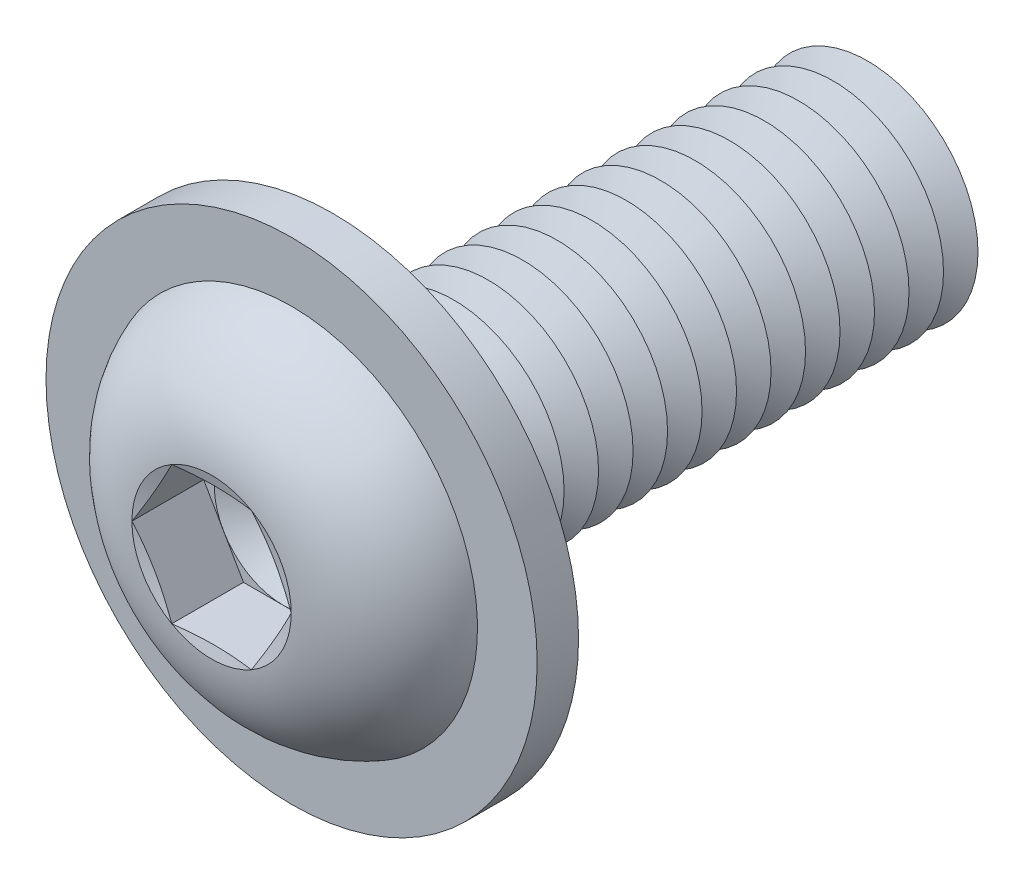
ISO-10303-21;
HEADER;
FILE_DESCRIPTION(('STEP AP214'),'2;1');
FILE_NAME('part.step','',(''),(''),'','','');
FILE_SCHEMA(('AUTOMOTIVE_DESIGN { 1 0 10303 214 1 1 1 1 }'));
ENDSEC;
DATA;
#1=APPLICATION_CONTEXT('core data for automotive mechanical design processes');
#2=APPLICATION_PROTOCOL_DEFINITION('international standard','automotive_design',2000,#1);
#3=PRODUCT_CONTEXT('',#1,'mechanical');
#4=PRODUCT('Part','Part','',(#3));
#5=PRODUCT_RELATED_PRODUCT_CATEGORY('part','',(#4));
#6=PRODUCT_DEFINITION_FORMATION('','',#4);
#7=PRODUCT_DEFINITION_CONTEXT('part definition',#1,'design');
#8=PRODUCT_DEFINITION('design','',#6,#7);
#9=PRODUCT_DEFINITION_SHAPE('','',#8);
#10=(LENGTH_UNIT() NAMED_UNIT(*) SI_UNIT(.MILLI.,.METRE.));
#11=(NAMED_UNIT(*) PLANE_ANGLE_UNIT() SI_UNIT($,.RADIAN.));
#12=(NAMED_UNIT(*) SI_UNIT($,.STERADIAN.) SOLID_ANGLE_UNIT());
#13=UNCERTAINTY_MEASURE_WITH_UNIT(LENGTH_MEASURE(1.E-05),#10,'distance_accuracy_value','');
#14=(GEOMETRIC_REPRESENTATION_CONTEXT(3) GLOBAL_UNCERTAINTY_ASSIGNED_CONTEXT((#13)) GLOBAL_UNIT_ASSIGNED_CONTEXT((#10,
#11,#12)) REPRESENTATION_CONTEXT('',''));
#15=CARTESIAN_POINT('',(0.,0.,0.));
#16=DIRECTION('',(0.,0.,1.));
#17=DIRECTION('',(1.,0.,0.));
#18=AXIS2_PLACEMENT_3D('',#15,#16,#17);
#19=CARTESIAN_POINT('',(0.,0.,-15.625));
#20=DIRECTION('',(0.,0.,1.));
#21=DIRECTION('',(1.,0.,0.));
#22=AXIS2_PLACEMENT_3D('',#19,#20,#21);
#23=CONICAL_SURFACE('',#22,4.00000000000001,1.0471975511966);
#24=CARTESIAN_POINT('',(0.,0.,-16.25));
#25=DIRECTION('',(0.,0.,1.));
#26=DIRECTION('',(1.,0.,0.));
#27=AXIS2_PLACEMENT_3D('',#24,#25,#26);
#28=CIRCLE('',#27,2.91746824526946);
#29=CARTESIAN_POINT('',(2.91746824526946,0.,-16.25));
#30=VERTEX_POINT('',#29);
#31=EDGE_CURVE('E338',#30,#30,#28,.T.);
#32=ORIENTED_EDGE('',*,*,#31,.T.);
#33=EDGE_LOOP('',(#32));
#34=FACE_BOUND('',#33,.T.);
#35=CARTESIAN_POINT('',(0.,0.,-15.625));
#36=DIRECTION('',(0.,0.,1.));
#37=DIRECTION('',(1.,0.,0.));
#38=AXIS2_PLACEMENT_3D('',#35,#36,#37);
#39=CIRCLE('',#38,4.00000000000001);
#40=CARTESIAN_POINT('',(4.00000000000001,0.,-15.625));
#41=VERTEX_POINT('',#40);
#42=EDGE_CURVE('E334',#41,#41,#39,.T.);
#43=ORIENTED_EDGE('',*,*,#42,.F.);
#44=EDGE_LOOP('',(#43));
#45=FACE_BOUND('',#44,.T.);
#46=ADVANCED_FACE('F39',(#34,#45),#23,.T.);
#47=CARTESIAN_POINT('',(0.,0.,-16.25));
#48=DIRECTION('',(0.,0.,-1.));
#49=DIRECTION('',(-1.,0.,0.));
#50=AXIS2_PLACEMENT_3D('',#47,#48,#49);
#51=CONICAL_SURFACE('',#50,2.91746824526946,1.0471975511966);
#52=CARTESIAN_POINT('',(0.,0.,-16.875));
#53=DIRECTION('',(0.,0.,1.));
#54=DIRECTION('',(1.,0.,0.));
#55=AXIS2_PLACEMENT_3D('',#52,#53,#54);
#56=CIRCLE('',#55,4.00000000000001);
#57=CARTESIAN_POINT('',(4.00000000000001,0.,-16.875));
#58=VERTEX_POINT('',#57);
#59=EDGE_CURVE('E342',#58,#58,#56,.T.);
#60=ORIENTED_EDGE('',*,*,#59,.T.);
#61=EDGE_LOOP('',(#60));
#62=FACE_BOUND('',#61,.T.);
#63=ORIENTED_EDGE('',*,*,#31,.F.);
#64=EDGE_LOOP('',(#63));
#65=FACE_BOUND('',#64,.T.);
#66=ADVANCED_FACE('F469',(#62,#65),#51,.T.);
#67=CARTESIAN_POINT('',(0.,4.00000000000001,-20.));
#68=DIRECTION('',(0.,0.,-1.));
#69=DIRECTION('',(-1.,0.,0.));
#70=AXIS2_PLACEMENT_3D('',#67,#68,#69);
#71=PLANE('',#70);
#72=CARTESIAN_POINT('',(0.,0.,-20.));
#73=DIRECTION('',(0.,0.,1.));
#74=DIRECTION('',(1.,0.,0.));
#75=AXIS2_PLACEMENT_3D('',#72,#73,#74);
#76=CIRCLE('',#75,2.91746824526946);
#77=CARTESIAN_POINT('',(2.91746824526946,0.,-20.));
#78=VERTEX_POINT('',#77);
#79=EDGE_CURVE('E361',#78,#78,#76,.T.);
#80=ORIENTED_EDGE('',*,*,#79,.F.);
#81=EDGE_LOOP('',(#80));
#82=FACE_BOUND('',#81,.T.);
#83=ADVANCED_FACE('F475',(#82),#71,.T.);
#84=CARTESIAN_POINT('',(0.,0.,-19.375));
#85=DIRECTION('',(0.,0.,1.));
#86=DIRECTION('',(1.,0.,0.));
#87=AXIS2_PLACEMENT_3D('',#84,#85,#86);
#88=CONICAL_SURFACE('',#87,4.00000000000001,1.0471975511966);
#89=ORIENTED_EDGE('',*,*,#79,.T.);
#90=EDGE_LOOP('',(#89));
#91=FACE_BOUND('',#90,.T.);
#92=CARTESIAN_POINT('',(0.,0.,-19.375));
#93=DIRECTION('',(0.,0.,1.));
#94=DIRECTION('',(1.,0.,0.));
#95=AXIS2_PLACEMENT_3D('',#92,#93,#94);
#96=CIRCLE('',#95,4.00000000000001);
#97=CARTESIAN_POINT('',(4.00000000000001,0.,-19.375));
#98=VERTEX_POINT('',#97);
#99=EDGE_CURVE('E357',#98,#98,#96,.T.);
#100=ORIENTED_EDGE('',*,*,#99,.F.);
#101=EDGE_LOOP('',(#100));
#102=FACE_BOUND('',#101,.T.);
#103=ADVANCED_FACE('F494',(#91,#102),#88,.T.);
#104=CARTESIAN_POINT('',(0.,0.,-18.75));
#105=DIRECTION('',(0.,0.,-1.));
#106=DIRECTION('',(-1.,0.,0.));
#107=AXIS2_PLACEMENT_3D('',#104,#105,#106);
#108=CONICAL_SURFACE('',#107,2.91746824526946,1.0471975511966);
#109=ORIENTED_EDGE('',*,*,#99,.T.);
#110=EDGE_LOOP('',(#109));
#111=FACE_BOUND('',#110,.T.);
#112=CARTESIAN_POINT('',(0.,0.,-18.75));
#113=DIRECTION('',(0.,0.,1.));
#114=DIRECTION('',(1.,0.,0.));
#115=AXIS2_PLACEMENT_3D('',#112,#113,#114);
#116=CIRCLE('',#115,2.91746824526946);
#117=CARTESIAN_POINT('',(2.91746824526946,0.,-18.75));
#118=VERTEX_POINT('',#117);
#119=EDGE_CURVE('E353',#118,#118,#116,.T.);
#120=ORIENTED_EDGE('',*,*,#119,.F.);
#121=EDGE_LOOP('',(#120));
#122=FACE_BOUND('',#121,.T.);
#123=ADVANCED_FACE('F491',(#111,#122),#108,.T.);
#124=CARTESIAN_POINT('',(0.,0.,-18.125));
#125=DIRECTION('',(0.,0.,1.));
#126=DIRECTION('',(1.,0.,0.));
#127=AXIS2_PLACEMENT_3D('',#124,#125,#126);
#128=CONICAL_SURFACE('',#127,4.00000000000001,1.0471975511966);
#129=ORIENTED_EDGE('',*,*,#119,.T.);
#130=EDGE_LOOP('',(#129));
#131=FACE_BOUND('',#130,.T.);
#132=CARTESIAN_POINT('',(0.,0.,-18.125));
#133=DIRECTION('',(0.,0.,1.));
#134=DIRECTION('',(1.,0.,0.));
#135=AXIS2_PLACEMENT_3D('',#132,#133,#134);
#136=CIRCLE('',#135,4.00000000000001);
#137=CARTESIAN_POINT('',(4.00000000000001,0.,-18.125));
#138=VERTEX_POINT('',#137);
#139=EDGE_CURVE('E349',#138,#138,#136,.T.);
#140=ORIENTED_EDGE('',*,*,#139,.F.);
#141=EDGE_LOOP('',(#140));
#142=FACE_BOUND('',#141,.T.);
#143=ADVANCED_FACE('F485',(#131,#142),#128,.T.);
#144=CARTESIAN_POINT('',(0.,0.,-17.5));
#145=DIRECTION('',(0.,0.,-1.));
#146=DIRECTION('',(-1.,0.,0.));
#147=AXIS2_PLACEMENT_3D('',#144,#145,#146);
#148=CONICAL_SURFACE('',#147,2.91746824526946,1.0471975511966);
#149=ORIENTED_EDGE('',*,*,#139,.T.);
#150=EDGE_LOOP('',(#149));
#151=FACE_BOUND('',#150,.T.);
#152=CARTESIAN_POINT('',(0.,0.,-17.5));
#153=DIRECTION('',(0.,0.,1.));
#154=DIRECTION('',(1.,0.,0.));
#155=AXIS2_PLACEMENT_3D('',#152,#153,#154);
#156=CIRCLE('',#155,2.91746824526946);
#157=CARTESIAN_POINT('',(2.91746824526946,0.,-17.5));
#158=VERTEX_POINT('',#157);
#159=EDGE_CURVE('E345',#158,#158,#156,.T.);
#160=ORIENTED_EDGE('',*,*,#159,.F.);
#161=EDGE_LOOP('',(#160));
#162=FACE_BOUND('',#161,.T.);
#163=ADVANCED_FACE('F481',(#151,#162),#148,.T.);
#164=CARTESIAN_POINT('',(0.,0.,-16.875));
#165=DIRECTION('',(0.,0.,1.));
#166=DIRECTION('',(1.,0.,0.));
#167=AXIS2_PLACEMENT_3D('',#164,#165,#166);
#168=CONICAL_SURFACE('',#167,4.00000000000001,1.0471975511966);
#169=ORIENTED_EDGE('',*,*,#159,.T.);
#170=EDGE_LOOP('',(#169));
#171=FACE_BOUND('',#170,.T.);
#172=ORIENTED_EDGE('',*,*,#59,.F.);
#173=EDGE_LOOP('',(#172));
#174=FACE_BOUND('',#173,.T.);
#175=ADVANCED_FACE('F484',(#171,#174),#168,.T.);
#176=CARTESIAN_POINT('',(0.,0.,-14.375));
#177=DIRECTION('',(0.,0.,1.));
#178=DIRECTION('',(1.,0.,0.));
#179=AXIS2_PLACEMENT_3D('',#176,#177,#178);
#180=CONICAL_SURFACE('',#179,4.00000000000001,1.0471975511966);
#181=CARTESIAN_POINT('',(0.,0.,-15.));
#182=DIRECTION('',(0.,0.,1.));
#183=DIRECTION('',(1.,0.,0.));
#184=AXIS2_PLACEMENT_3D('',#181,#182,#183);
#185=CIRCLE('',#184,2.91746824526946);
#186=CARTESIAN_POINT('',(2.91746824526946,0.,-15.));
#187=VERTEX_POINT('',#186);
#188=EDGE_CURVE('E330',#187,#187,#185,.T.);
#189=ORIENTED_EDGE('',*,*,#188,.T.);
#190=EDGE_LOOP('',(#189));
#191=FACE_BOUND('',#190,.T.);
#192=CARTESIAN_POINT('',(0.,0.,-14.375));
#193=DIRECTION('',(0.,0.,1.));
#194=DIRECTION('',(1.,0.,0.));
#195=AXIS2_PLACEMENT_3D('',#192,#193,#194);
#196=CIRCLE('',#195,4.00000000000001);
#197=CARTESIAN_POINT('',(4.00000000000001,0.,-14.375));
#198=VERTEX_POINT('',#197);
#199=EDGE_CURVE('E326',#198,#198,#196,.T.);
#200=ORIENTED_EDGE('',*,*,#199,.F.);
#201=EDGE_LOOP('',(#200));
#202=FACE_BOUND('',#201,.T.);
#203=ADVANCED_FACE('F489',(#191,#202),#180,.T.);
#204=CARTESIAN_POINT('',(0.,0.,-15.));
#205=DIRECTION('',(0.,0.,-1.));
#206=DIRECTION('',(-1.,0.,0.));
#207=AXIS2_PLACEMENT_3D('',#204,#205,#206);
#208=CONICAL_SURFACE('',#207,2.91746824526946,1.0471975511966);
#209=ORIENTED_EDGE('',*,*,#42,.T.);
#210=EDGE_LOOP('',(#209));
#211=FACE_BOUND('',#210,.T.);
#212=ORIENTED_EDGE('',*,*,#188,.F.);
#213=EDGE_LOOP('',(#212));
#214=FACE_BOUND('',#213,.T.);
#215=ADVANCED_FACE('F540',(#211,#214),#208,.T.);
#216=CARTESIAN_POINT('',(0.,0.,-13.125));
#217=DIRECTION('',(0.,0.,1.));
#218=DIRECTION('',(1.,0.,0.));
#219=AXIS2_PLACEMENT_3D('',#216,#217,#218);
#220=CONICAL_SURFACE('',#219,4.00000000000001,1.0471975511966);
#221=CARTESIAN_POINT('',(0.,0.,-13.75));
#222=DIRECTION('',(0.,0.,1.));
#223=DIRECTION('',(1.,0.,0.));
#224=AXIS2_PLACEMENT_3D('',#221,#222,#223);
#225=CIRCLE('',#224,2.91746824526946);
#226=CARTESIAN_POINT('',(2.91746824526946,0.,-13.75));
#227=VERTEX_POINT('',#226);
#228=EDGE_CURVE('E322',#227,#227,#225,.T.);
#229=ORIENTED_EDGE('',*,*,#228,.T.);
#230=EDGE_LOOP('',(#229));
#231=FACE_BOUND('',#230,.T.);
#232=CARTESIAN_POINT('',(0.,0.,-13.125));
#233=DIRECTION('',(0.,0.,1.));
#234=DIRECTION('',(1.,0.,0.));
#235=AXIS2_PLACEMENT_3D('',#232,#233,#234);
#236=CIRCLE('',#235,4.00000000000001);
#237=CARTESIAN_POINT('',(4.00000000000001,0.,-13.125));
#238=VERTEX_POINT('',#237);
#239=EDGE_CURVE('E318',#238,#238,#236,.T.);
#240=ORIENTED_EDGE('',*,*,#239,.F.);
#241=EDGE_LOOP('',(#240));
#242=FACE_BOUND('',#241,.T.);
#243=ADVANCED_FACE('F546',(#231,#242),#220,.T.);
#244=CARTESIAN_POINT('',(0.,0.,-13.75));
#245=DIRECTION('',(0.,0.,-1.));
#246=DIRECTION('',(-1.,0.,0.));
#247=AXIS2_PLACEMENT_3D('',#244,#245,#246);
#248=CONICAL_SURFACE('',#247,2.91746824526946,1.0471975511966);
#249=ORIENTED_EDGE('',*,*,#199,.T.);
#250=EDGE_LOOP('',(#249));
#251=FACE_BOUND('',#250,.T.);
#252=ORIENTED_EDGE('',*,*,#228,.F.);
#253=EDGE_LOOP('',(#252));
#254=FACE_BOUND('',#253,.T.);
#255=ADVANCED_FACE('F553',(#251,#254),#248,.T.);
#256=CARTESIAN_POINT('',(0.,0.,-11.875));
#257=DIRECTION('',(0.,0.,1.));
#258=DIRECTION('',(1.,0.,0.));
#259=AXIS2_PLACEMENT_3D('',#256,#257,#258);
#260=CONICAL_SURFACE('',#259,4.00000000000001,1.0471975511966);
#261=CARTESIAN_POINT('',(0.,0.,-12.5));
#262=DIRECTION('',(0.,0.,1.));
#263=DIRECTION('',(1.,0.,0.));
#264=AXIS2_PLACEMENT_3D('',#261,#262,#263);
#265=CIRCLE('',#264,2.91746824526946);
#266=CARTESIAN_POINT('',(2.91746824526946,0.,-12.5));
#267=VERTEX_POINT('',#266);
#268=EDGE_CURVE('E314',#267,#267,#265,.T.);
#269=ORIENTED_EDGE('',*,*,#268,.T.);
#270=EDGE_LOOP('',(#269));
#271=FACE_BOUND('',#270,.T.);
#272=CARTESIAN_POINT('',(0.,0.,-11.875));
#273=DIRECTION('',(0.,0.,1.));
#274=DIRECTION('',(1.,0.,0.));
#275=AXIS2_PLACEMENT_3D('',#272,#273,#274);
#276=CIRCLE('',#275,4.00000000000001);
#277=CARTESIAN_POINT('',(4.00000000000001,0.,-11.875));
#278=VERTEX_POINT('',#277);
#279=EDGE_CURVE('E310',#278,#278,#276,.T.);
#280=ORIENTED_EDGE('',*,*,#279,.F.);
#281=EDGE_LOOP('',(#280));
#282=FACE_BOUND('',#281,.T.);
#283=ADVANCED_FACE('F560',(#271,#282),#260,.T.);
#284=CARTESIAN_POINT('',(0.,0.,-12.5));
#285=DIRECTION('',(0.,0.,-1.));
#286=DIRECTION('',(-1.,0.,0.));
#287=AXIS2_PLACEMENT_3D('',#284,#285,#286);
#288=CONICAL_SURFACE('',#287,2.91746824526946,1.0471975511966);
#289=ORIENTED_EDGE('',*,*,#239,.T.);
#290=EDGE_LOOP('',(#289));
#291=FACE_BOUND('',#290,.T.);
#292=ORIENTED_EDGE('',*,*,#268,.F.);
#293=EDGE_LOOP('',(#292));
#294=FACE_BOUND('',#293,.T.);
#295=ADVANCED_FACE('F567',(#291,#294),#288,.T.);
#296=CARTESIAN_POINT('',(0.,0.,-10.625));
#297=DIRECTION('',(0.,0.,1.));
#298=DIRECTION('',(1.,0.,0.));
#299=AXIS2_PLACEMENT_3D('',#296,#297,#298);
#300=CONICAL_SURFACE('',#299,4.00000000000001,1.0471975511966);
#301=CARTESIAN_POINT('',(0.,0.,-11.25));
#302=DIRECTION('',(0.,0.,1.));
#303=DIRECTION('',(1.,0.,0.));
#304=AXIS2_PLACEMENT_3D('',#301,#302,#303);
#305=CIRCLE('',#304,2.91746824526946);
#306=CARTESIAN_POINT('',(2.91746824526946,0.,-11.25));
#307=VERTEX_POINT('',#306);
#308=EDGE_CURVE('E306',#307,#307,#305,.T.);
#309=ORIENTED_EDGE('',*,*,#308,.T.);
#310=EDGE_LOOP('',(#309));
#311=FACE_BOUND('',#310,.T.);
#312=CARTESIAN_POINT('',(0.,0.,-10.625));
#313=DIRECTION('',(0.,0.,1.));
#314=DIRECTION('',(1.,0.,0.));
#315=AXIS2_PLACEMENT_3D('',#312,#313,#314);
#316=CIRCLE('',#315,4.00000000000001);
#317=CARTESIAN_POINT('',(4.00000000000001,0.,-10.625));
#318=VERTEX_POINT('',#317);
#319=EDGE_CURVE('E302',#318,#318,#316,.T.);
#320=ORIENTED_EDGE('',*,*,#319,.F.);
#321=EDGE_LOOP('',(#320));
#322=FACE_BOUND('',#321,.T.);
#323=ADVANCED_FACE('F574',(#311,#322),#300,.T.);
#324=CARTESIAN_POINT('',(0.,0.,-11.25));
#325=DIRECTION('',(0.,0.,-1.));
#326=DIRECTION('',(-1.,0.,0.));
#327=AXIS2_PLACEMENT_3D('',#324,#325,#326);
#328=CONICAL_SURFACE('',#327,2.91746824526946,1.0471975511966);
#329=ORIENTED_EDGE('',*,*,#279,.T.);
#330=EDGE_LOOP('',(#329));
#331=FACE_BOUND('',#330,.T.);
#332=ORIENTED_EDGE('',*,*,#308,.F.);
#333=EDGE_LOOP('',(#332));
#334=FACE_BOUND('',#333,.T.);
#335=ADVANCED_FACE('F581',(#331,#334),#328,.T.);
#336=CARTESIAN_POINT('',(0.,0.,-9.375));
#337=DIRECTION('',(0.,0.,1.));
#338=DIRECTION('',(1.,0.,0.));
#339=AXIS2_PLACEMENT_3D('',#336,#337,#338);
#340=CONICAL_SURFACE('',#339,4.00000000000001,1.0471975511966);
#341=CARTESIAN_POINT('',(0.,0.,-10.));
#342=DIRECTION('',(0.,0.,1.));
#343=DIRECTION('',(1.,0.,0.));
#344=AXIS2_PLACEMENT_3D('',#341,#342,#343);
#345=CIRCLE('',#344,2.91746824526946);
#346=CARTESIAN_POINT('',(2.91746824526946,0.,-10.));
#347=VERTEX_POINT('',#346);
#348=EDGE_CURVE('E298',#347,#347,#345,.T.);
#349=ORIENTED_EDGE('',*,*,#348,.T.);
#350=EDGE_LOOP('',(#349));
#351=FACE_BOUND('',#350,.T.);
#352=CARTESIAN_POINT('',(0.,0.,-9.375));
#353=DIRECTION('',(0.,0.,1.));
#354=DIRECTION('',(1.,0.,0.));
#355=AXIS2_PLACEMENT_3D('',#352,#353,#354);
#356=CIRCLE('',#355,4.00000000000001);
#357=CARTESIAN_POINT('',(4.00000000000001,0.,-9.375));
#358=VERTEX_POINT('',#357);
#359=EDGE_CURVE('E294',#358,#358,#356,.T.);
#360=ORIENTED_EDGE('',*,*,#359,.F.);
#361=EDGE_LOOP('',(#360));
#362=FACE_BOUND('',#361,.T.);
#363=ADVANCED_FACE('F588',(#351,#362),#340,.T.);
#364=CARTESIAN_POINT('',(0.,0.,-10.));
#365=DIRECTION('',(0.,0.,-1.));
#366=DIRECTION('',(-1.,0.,0.));
#367=AXIS2_PLACEMENT_3D('',#364,#365,#366);
#368=CONICAL_SURFACE('',#367,2.91746824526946,1.0471975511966);
#369=ORIENTED_EDGE('',*,*,#319,.T.);
#370=EDGE_LOOP('',(#369));
#371=FACE_BOUND('',#370,.T.);
#372=ORIENTED_EDGE('',*,*,#348,.F.);
#373=EDGE_LOOP('',(#372));
#374=FACE_BOUND('',#373,.T.);
#375=ADVANCED_FACE('F595',(#371,#374),#368,.T.);
#376=CARTESIAN_POINT('',(0.,0.,-8.125));
#377=DIRECTION('',(0.,0.,1.));
#378=DIRECTION('',(1.,0.,0.));
#379=AXIS2_PLACEMENT_3D('',#376,#377,#378);
#380=CONICAL_SURFACE('',#379,4.00000000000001,1.0471975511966);
#381=CARTESIAN_POINT('',(0.,0.,-8.75));
#382=DIRECTION('',(0.,0.,1.));
#383=DIRECTION('',(1.,0.,0.));
#384=AXIS2_PLACEMENT_3D('',#381,#382,#383);
#385=CIRCLE('',#384,2.91746824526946);
#386=CARTESIAN_POINT('',(2.91746824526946,0.,-8.75));
#387=VERTEX_POINT('',#386);
#388=EDGE_CURVE('E290',#387,#387,#385,.T.);
#389=ORIENTED_EDGE('',*,*,#388,.T.);
#390=EDGE_LOOP('',(#389));
#391=FACE_BOUND('',#390,.T.);
#392=CARTESIAN_POINT('',(0.,0.,-8.125));
#393=DIRECTION('',(0.,0.,1.));
#394=DIRECTION('',(1.,0.,0.));
#395=AXIS2_PLACEMENT_3D('',#392,#393,#394);
#396=CIRCLE('',#395,4.00000000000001);
#397=CARTESIAN_POINT('',(4.00000000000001,0.,-8.125));
#398=VERTEX_POINT('',#397);
#399=EDGE_CURVE('E286',#398,#398,#396,.T.);
#400=ORIENTED_EDGE('',*,*,#399,.F.);
#401=EDGE_LOOP('',(#400));
#402=FACE_BOUND('',#401,.T.);
#403=ADVANCED_FACE('F602',(#391,#402),#380,.T.);
#404=CARTESIAN_POINT('',(0.,0.,-8.75));
#405=DIRECTION('',(0.,0.,-1.));
#406=DIRECTION('',(-1.,0.,0.));
#407=AXIS2_PLACEMENT_3D('',#404,#405,#406);
#408=CONICAL_SURFACE('',#407,2.91746824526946,1.0471975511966);
#409=ORIENTED_EDGE('',*,*,#359,.T.);
#410=EDGE_LOOP('',(#409));
#411=FACE_BOUND('',#410,.T.);
#412=ORIENTED_EDGE('',*,*,#388,.F.);
#413=EDGE_LOOP('',(#412));
#414=FACE_BOUND('',#413,.T.);
#415=ADVANCED_FACE('F609',(#411,#414),#408,.T.);
#416=CARTESIAN_POINT('',(0.,0.,-6.875));
#417=DIRECTION('',(0.,0.,1.));
#418=DIRECTION('',(1.,0.,0.));
#419=AXIS2_PLACEMENT_3D('',#416,#417,#418);
#420=CONICAL_SURFACE('',#419,4.00000000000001,1.0471975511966);
#421=CARTESIAN_POINT('',(0.,0.,-7.5));
#422=DIRECTION('',(0.,0.,1.));
#423=DIRECTION('',(1.,0.,0.));
#424=AXIS2_PLACEMENT_3D('',#421,#422,#423);
#425=CIRCLE('',#424,2.91746824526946);
#426=CARTESIAN_POINT('',(2.91746824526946,0.,-7.5));
#427=VERTEX_POINT('',#426);
#428=EDGE_CURVE('E282',#427,#427,#425,.T.);
#429=ORIENTED_EDGE('',*,*,#428,.T.);
#430=EDGE_LOOP('',(#429));
#431=FACE_BOUND('',#430,.T.);
#432=CARTESIAN_POINT('',(0.,0.,-6.875));
#433=DIRECTION('',(0.,0.,1.));
#434=DIRECTION('',(1.,0.,0.));
#435=AXIS2_PLACEMENT_3D('',#432,#433,#434);
#436=CIRCLE('',#435,4.00000000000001);
#437=CARTESIAN_POINT('',(4.00000000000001,0.,-6.875));
#438=VERTEX_POINT('',#437);
#439=EDGE_CURVE('E278',#438,#438,#436,.T.);
#440=ORIENTED_EDGE('',*,*,#439,.F.);
#441=EDGE_LOOP('',(#440));
#442=FACE_BOUND('',#441,.T.);
#443=ADVANCED_FACE('F616',(#431,#442),#420,.T.);
#444=CARTESIAN_POINT('',(0.,0.,-7.5));
#445=DIRECTION('',(0.,0.,-1.));
#446=DIRECTION('',(-1.,0.,0.));
#447=AXIS2_PLACEMENT_3D('',#444,#445,#446);
#448=CONICAL_SURFACE('',#447,2.91746824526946,1.0471975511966);
#449=ORIENTED_EDGE('',*,*,#399,.T.);
#450=EDGE_LOOP('',(#449));
#451=FACE_BOUND('',#450,.T.);
#452=ORIENTED_EDGE('',*,*,#428,.F.);
#453=EDGE_LOOP('',(#452));
#454=FACE_BOUND('',#453,.T.);
#455=ADVANCED_FACE('F623',(#451,#454),#448,.T.);
#456=CARTESIAN_POINT('',(0.,0.,-5.625));
#457=DIRECTION('',(0.,0.,1.));
#458=DIRECTION('',(1.,0.,0.));
#459=AXIS2_PLACEMENT_3D('',#456,#457,#458);
#460=CONICAL_SURFACE('',#459,4.00000000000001,1.0471975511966);
#461=CARTESIAN_POINT('',(0.,0.,-6.25));
#462=DIRECTION('',(0.,0.,1.));
#463=DIRECTION('',(1.,0.,0.));
#464=AXIS2_PLACEMENT_3D('',#461,#462,#463);
#465=CIRCLE('',#464,2.91746824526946);
#466=CARTESIAN_POINT('',(2.91746824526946,0.,-6.25));
#467=VERTEX_POINT('',#466);
#468=EDGE_CURVE('E274',#467,#467,#465,.T.);
#469=ORIENTED_EDGE('',*,*,#468,.T.);
#470=EDGE_LOOP('',(#469));
#471=FACE_BOUND('',#470,.T.);
#472=CARTESIAN_POINT('',(0.,0.,-5.625));
#473=DIRECTION('',(0.,0.,1.));
#474=DIRECTION('',(1.,0.,0.));
#475=AXIS2_PLACEMENT_3D('',#472,#473,#474);
#476=CIRCLE('',#475,4.00000000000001);
#477=CARTESIAN_POINT('',(4.00000000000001,0.,-5.625));
#478=VERTEX_POINT('',#477);
#479=EDGE_CURVE('E270',#478,#478,#476,.T.);
#480=ORIENTED_EDGE('',*,*,#479,.F.);
#481=EDGE_LOOP('',(#480));
#482=FACE_BOUND('',#481,.T.);
#483=ADVANCED_FACE('F630',(#471,#482),#460,.T.);
#484=CARTESIAN_POINT('',(0.,0.,-6.25));
#485=DIRECTION('',(0.,0.,-1.));
#486=DIRECTION('',(-1.,0.,0.));
#487=AXIS2_PLACEMENT_3D('',#484,#485,#486);
#488=CONICAL_SURFACE('',#487,2.91746824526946,1.0471975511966);
#489=ORIENTED_EDGE('',*,*,#439,.T.);
#490=EDGE_LOOP('',(#489));
#491=FACE_BOUND('',#490,.T.);
#492=ORIENTED_EDGE('',*,*,#468,.F.);
#493=EDGE_LOOP('',(#492));
#494=FACE_BOUND('',#493,.T.);
#495=ADVANCED_FACE('F637',(#491,#494),#488,.T.);
#496=CARTESIAN_POINT('',(0.,0.,-4.375));
#497=DIRECTION('',(0.,0.,1.));
#498=DIRECTION('',(1.,0.,0.));
#499=AXIS2_PLACEMENT_3D('',#496,#497,#498);
#500=CONICAL_SURFACE('',#499,4.00000000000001,1.0471975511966);
#501=CARTESIAN_POINT('',(0.,0.,-5.));
#502=DIRECTION('',(0.,0.,1.));
#503=DIRECTION('',(1.,0.,0.));
#504=AXIS2_PLACEMENT_3D('',#501,#502,#503);
#505=CIRCLE('',#504,2.91746824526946);
#506=CARTESIAN_POINT('',(2.91746824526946,0.,-5.));
#507=VERTEX_POINT('',#506);
#508=EDGE_CURVE('E266',#507,#507,#505,.T.);
#509=ORIENTED_EDGE('',*,*,#508,.T.);
#510=EDGE_LOOP('',(#509));
#511=FACE_BOUND('',#510,.T.);
#512=CARTESIAN_POINT('',(0.,0.,-4.375));
#513=DIRECTION('',(0.,0.,1.));
#514=DIRECTION('',(1.,0.,0.));
#515=AXIS2_PLACEMENT_3D('',#512,#513,#514);
#516=CIRCLE('',#515,4.00000000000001);
#517=CARTESIAN_POINT('',(4.00000000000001,0.,-4.375));
#518=VERTEX_POINT('',#517);
#519=EDGE_CURVE('E262',#518,#518,#516,.T.);
#520=ORIENTED_EDGE('',*,*,#519,.F.);
#521=EDGE_LOOP('',(#520));
#522=FACE_BOUND('',#521,.T.);
#523=ADVANCED_FACE('F644',(#511,#522),#500,.T.);
#524=CARTESIAN_POINT('',(0.,0.,-5.));
#525=DIRECTION('',(0.,0.,-1.));
#526=DIRECTION('',(-1.,0.,0.));
#527=AXIS2_PLACEMENT_3D('',#524,#525,#526);
#528=CONICAL_SURFACE('',#527,2.91746824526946,1.0471975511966);
#529=ORIENTED_EDGE('',*,*,#479,.T.);
#530=EDGE_LOOP('',(#529));
#531=FACE_BOUND('',#530,.T.);
#532=ORIENTED_EDGE('',*,*,#508,.F.);
#533=EDGE_LOOP('',(#532));
#534=FACE_BOUND('',#533,.T.);
#535=ADVANCED_FACE('F651',(#531,#534),#528,.T.);
#536=CARTESIAN_POINT('',(0.,0.,-3.125));
#537=DIRECTION('',(0.,0.,1.));
#538=DIRECTION('',(1.,0.,0.));
#539=AXIS2_PLACEMENT_3D('',#536,#537,#538);
#540=CONICAL_SURFACE('',#539,4.00000000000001,1.0471975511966);
#541=CARTESIAN_POINT('',(0.,0.,-3.75));
#542=DIRECTION('',(0.,0.,1.));
#543=DIRECTION('',(1.,0.,0.));
#544=AXIS2_PLACEMENT_3D('',#541,#542,#543);
#545=CIRCLE('',#544,2.91746824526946);
#546=CARTESIAN_POINT('',(2.91746824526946,0.,-3.75));
#547=VERTEX_POINT('',#546);
#548=EDGE_CURVE('E258',#547,#547,#545,.T.);
#549=ORIENTED_EDGE('',*,*,#548,.T.);
#550=EDGE_LOOP('',(#549));
#551=FACE_BOUND('',#550,.T.);
#552=CARTESIAN_POINT('',(0.,0.,-3.125));
#553=DIRECTION('',(0.,0.,1.));
#554=DIRECTION('',(1.,0.,0.));
#555=AXIS2_PLACEMENT_3D('',#552,#553,#554);
#556=CIRCLE('',#555,4.00000000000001);
#557=CARTESIAN_POINT('',(4.00000000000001,0.,-3.125));
#558=VERTEX_POINT('',#557);
#559=EDGE_CURVE('E254',#558,#558,#556,.T.);
#560=ORIENTED_EDGE('',*,*,#559,.F.);
#561=EDGE_LOOP('',(#560));
#562=FACE_BOUND('',#561,.T.);
#563=ADVANCED_FACE('F658',(#551,#562),#540,.T.);
#564=CARTESIAN_POINT('',(0.,0.,-3.75));
#565=DIRECTION('',(0.,0.,-1.));
#566=DIRECTION('',(-1.,0.,0.));
#567=AXIS2_PLACEMENT_3D('',#564,#565,#566);
#568=CONICAL_SURFACE('',#567,2.91746824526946,1.0471975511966);
#569=ORIENTED_EDGE('',*,*,#519,.T.);
#570=EDGE_LOOP('',(#569));
#571=FACE_BOUND('',#570,.T.);
#572=ORIENTED_EDGE('',*,*,#548,.F.);
#573=EDGE_LOOP('',(#572));
#574=FACE_BOUND('',#573,.T.);
#575=ADVANCED_FACE('F665',(#571,#574),#568,.T.);
#576=CARTESIAN_POINT('',(0.,0.,-1.875));
#577=DIRECTION('',(0.,0.,1.));
#578=DIRECTION('',(1.,0.,0.));
#579=AXIS2_PLACEMENT_3D('',#576,#577,#578);
#580=CONICAL_SURFACE('',#579,4.00000000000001,1.0471975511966);
#581=CARTESIAN_POINT('',(0.,0.,-2.5));
#582=DIRECTION('',(0.,0.,1.));
#583=DIRECTION('',(1.,0.,0.));
#584=AXIS2_PLACEMENT_3D('',#581,#582,#583);
#585=CIRCLE('',#584,2.91746824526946);
#586=CARTESIAN_POINT('',(2.91746824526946,0.,-2.5));
#587=VERTEX_POINT('',#586);
#588=EDGE_CURVE('E250',#587,#587,#585,.T.);
#589=ORIENTED_EDGE('',*,*,#588,.T.);
#590=EDGE_LOOP('',(#589));
#591=FACE_BOUND('',#590,.T.);
#592=CARTESIAN_POINT('',(0.,0.,-1.875));
#593=DIRECTION('',(0.,0.,1.));
#594=DIRECTION('',(1.,0.,0.));
#595=AXIS2_PLACEMENT_3D('',#592,#593,#594);
#596=CIRCLE('',#595,4.00000000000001);
#597=CARTESIAN_POINT('',(4.00000000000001,0.,-1.875));
#598=VERTEX_POINT('',#597);
#599=EDGE_CURVE('E242',#598,#598,#596,.T.);
#600=ORIENTED_EDGE('',*,*,#599,.F.);
#601=EDGE_LOOP('',(#600));
#602=FACE_BOUND('',#601,.T.);
#603=ADVANCED_FACE('F672',(#591,#602),#580,.T.);
#604=CARTESIAN_POINT('',(0.,0.,-2.5));
#605=DIRECTION('',(0.,0.,-1.));
#606=DIRECTION('',(-1.,0.,0.));
#607=AXIS2_PLACEMENT_3D('',#604,#605,#606);
#608=CONICAL_SURFACE('',#607,2.91746824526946,1.0471975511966);
#609=ORIENTED_EDGE('',*,*,#559,.T.);
#610=EDGE_LOOP('',(#609));
#611=FACE_BOUND('',#610,.T.);
#612=ORIENTED_EDGE('',*,*,#588,.F.);
#613=EDGE_LOOP('',(#612));
#614=FACE_BOUND('',#613,.T.);
#615=ADVANCED_FACE('F679',(#611,#614),#608,.T.);
#616=CARTESIAN_POINT('',(0.,0.,-0.625000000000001));
#617=DIRECTION('',(0.,0.,1.));
#618=DIRECTION('',(1.,0.,0.));
#619=AXIS2_PLACEMENT_3D('',#616,#617,#618);
#620=CONICAL_SURFACE('',#619,4.00000000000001,1.0471975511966);
#621=CARTESIAN_POINT('',(0.,0.,-1.25));
#622=DIRECTION('',(0.,0.,1.));
#623=DIRECTION('',(1.,0.,0.));
#624=AXIS2_PLACEMENT_3D('',#621,#622,#623);
#625=CIRCLE('',#624,2.91746824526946);
#626=CARTESIAN_POINT('',(2.91746824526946,0.,-1.25));
#627=VERTEX_POINT('',#626);
#628=EDGE_CURVE('E231',#627,#627,#625,.T.);
#629=ORIENTED_EDGE('',*,*,#628,.T.);
#630=EDGE_LOOP('',(#629));
#631=FACE_BOUND('',#630,.T.);
#632=CARTESIAN_POINT('',(0.,0.,-0.625000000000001));
#633=DIRECTION('',(0.,0.,1.));
#634=DIRECTION('',(1.,0.,0.));
#635=AXIS2_PLACEMENT_3D('',#632,#633,#634);
#636=CIRCLE('',#635,4.00000000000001);
#637=CARTESIAN_POINT('',(4.00000000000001,0.,-0.625000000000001));
#638=VERTEX_POINT('',#637);
#639=EDGE_CURVE('E246',#638,#638,#636,.T.);
#640=ORIENTED_EDGE('',*,*,#639,.F.);
#641=EDGE_LOOP('',(#640));
#642=FACE_BOUND('',#641,.T.);
#643=ADVANCED_FACE('F686',(#631,#642),#620,.T.);
#644=CARTESIAN_POINT('',(0.,0.,-1.25));
#645=DIRECTION('',(0.,0.,-1.));
#646=DIRECTION('',(-1.,0.,0.));
#647=AXIS2_PLACEMENT_3D('',#644,#645,#646);
#648=CONICAL_SURFACE('',#647,2.91746824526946,1.0471975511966);
#649=ORIENTED_EDGE('',*,*,#599,.T.);
#650=EDGE_LOOP('',(#649));
#651=FACE_BOUND('',#650,.T.);
#652=ORIENTED_EDGE('',*,*,#628,.F.);
#653=EDGE_LOOP('',(#652));
#654=FACE_BOUND('',#653,.T.);
#655=ADVANCED_FACE('F220',(#651,#654),#648,.T.);
#656=CARTESIAN_POINT('',(0.,4.,0.));
#657=DIRECTION('',(0.,0.,-1.));
#658=DIRECTION('',(-1.,0.,0.));
#659=AXIS2_PLACEMENT_3D('',#656,#657,#658);
#660=PLANE('',#659);
#661=CARTESIAN_POINT('',(0.,0.,0.));
#662=DIRECTION('',(0.,0.,-1.));
#663=DIRECTION('',(-1.,0.,0.));
#664=AXIS2_PLACEMENT_3D('',#661,#662,#663);
#665=CIRCLE('',#664,4.62500000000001);
#666=CARTESIAN_POINT('',(-4.62500000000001,0.,0.));
#667=VERTEX_POINT('',#666);
#668=EDGE_CURVE('E370',#667,#667,#665,.F.);
#669=ORIENTED_EDGE('',*,*,#668,.T.);
#670=EDGE_LOOP('',(#669));
#671=FACE_BOUND('',#670,.T.);
#672=CARTESIAN_POINT('',(0.,0.,0.));
#673=DIRECTION('',(0.,0.,-1.));
#674=DIRECTION('',(0.,1.,0.));
#675=AXIS2_PLACEMENT_3D('',#672,#673,#674);
#676=CIRCLE('',#675,8.9);
#677=CARTESIAN_POINT('',(0.,8.9,0.));
#678=VERTEX_POINT('',#677);
#679=EDGE_CURVE('E447',#678,#678,#676,.T.);
#680=ORIENTED_EDGE('',*,*,#679,.T.);
#681=EDGE_LOOP('',(#680));
#682=FACE_BOUND('',#681,.T.);
#683=ADVANCED_FACE('F456',(#671,#682),#660,.T.);
#684=CARTESIAN_POINT('',(0.,0.,-0.625000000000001));
#685=DIRECTION('',(0.,0.,-1.));
#686=DIRECTION('',(-1.,0.,0.));
#687=AXIS2_PLACEMENT_3D('',#684,#685,#686);
#688=TOROIDAL_SURFACE('',#687,4.62500000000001,0.625);
#689=ORIENTED_EDGE('',*,*,#668,.F.);
#690=EDGE_LOOP('',(#689));
#691=FACE_BOUND('',#690,.T.);
#692=ORIENTED_EDGE('',*,*,#639,.T.);
#693=EDGE_LOOP('',(#692));
#694=FACE_BOUND('',#693,.T.);
#695=ADVANCED_FACE('F41',(#691,#694),#688,.F.);
#696=CARTESIAN_POINT('',(0.,0.,1.5));
#697=DIRECTION('',(0.,0.,-1.));
#698=DIRECTION('',(0.,1.,0.));
#699=AXIS2_PLACEMENT_3D('',#696,#697,#698);
#700=CYLINDRICAL_SURFACE('',#699,8.9);
#701=CARTESIAN_POINT('',(0.,0.,1.5));
#702=DIRECTION('',(0.,0.,-1.));
#703=DIRECTION('',(0.,1.,0.));
#704=AXIS2_PLACEMENT_3D('',#701,#702,#703);
#705=CIRCLE('',#704,8.9);
#706=CARTESIAN_POINT('',(0.,8.9,1.5));
#707=VERTEX_POINT('',#706);
#708=EDGE_CURVE('E444',#707,#707,#705,.T.);
#709=ORIENTED_EDGE('',*,*,#708,.T.);
#710=EDGE_LOOP('',(#709));
#711=FACE_BOUND('',#710,.T.);
#712=ORIENTED_EDGE('',*,*,#679,.F.);
#713=EDGE_LOOP('',(#712));
#714=FACE_BOUND('',#713,.T.);
#715=ADVANCED_FACE('F458',(#711,#714),#700,.T.);
#716=CARTESIAN_POINT('',(0.,0.,1.5));
#717=DIRECTION('',(0.,0.,-1.));
#718=DIRECTION('',(0.,1.,0.));
#719=AXIS2_PLACEMENT_3D('',#716,#717,#718);
#720=PLANE('',#719);
#721=CARTESIAN_POINT('',(0.,0.,1.5));
#722=DIRECTION('',(0.,0.,-1.));
#723=DIRECTION('',(0.,1.,0.));
#724=AXIS2_PLACEMENT_3D('',#721,#722,#723);
#725=CIRCLE('',#724,6.73705889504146);
#726=CARTESIAN_POINT('',(0.,6.73705889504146,1.5));
#727=VERTEX_POINT('',#726);
#728=EDGE_CURVE('E43',#727,#727,#725,.F.);
#729=ORIENTED_EDGE('',*,*,#728,.F.);
#730=EDGE_LOOP('',(#729));
#731=FACE_BOUND('',#730,.T.);
#732=ORIENTED_EDGE('',*,*,#708,.F.);
#733=EDGE_LOOP('',(#732));
#734=FACE_BOUND('',#733,.T.);
#735=ADVANCED_FACE('F117',(#731,#734),#720,.F.);
#736=CARTESIAN_POINT('',(0.,0.,1.8));
#737=DIRECTION('',(0.,0.,1.));
#738=DIRECTION('',(1.,0.,0.));
#739=AXIS2_PLACEMENT_3D('',#736,#737,#738);
#740=CONICAL_SURFACE('',#739,2.49999883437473,1.0471975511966);
#741=CARTESIAN_POINT('',(0.,0.,0.35662500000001));
#742=VERTEX_POINT('',#741);
#743=VERTEX_LOOP('',#742);
#744=FACE_BOUND('',#743,.T.);
#745=CARTESIAN_POINT('',(0.,0.,1.8));
#746=DIRECTION('',(0.,0.,1.));
#747=DIRECTION('',(1.,0.,0.));
#748=AXIS2_PLACEMENT_3D('',#745,#746,#747);
#749=CIRCLE('',#748,2.49999883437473);
#750=CARTESIAN_POINT('',(2.1650625,1.24999941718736,1.8));
#751=VERTEX_POINT('',#750);
#752=CARTESIAN_POINT('',(0.,2.49999883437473,1.8));
#753=VERTEX_POINT('',#752);
#754=EDGE_CURVE('E120',#751,#753,#749,.T.);
#755=ORIENTED_EDGE('',*,*,#754,.T.);
#756=CARTESIAN_POINT('',(0.,0.,1.8));
#757=DIRECTION('',(0.,0.,1.));
#758=DIRECTION('',(1.,0.,0.));
#759=AXIS2_PLACEMENT_3D('',#756,#757,#758);
#760=CIRCLE('',#759,2.49999883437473);
#761=CARTESIAN_POINT('',(-2.1650625,1.24999941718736,1.8));
#762=VERTEX_POINT('',#761);
#763=EDGE_CURVE('E11',#753,#762,#760,.T.);
#764=ORIENTED_EDGE('',*,*,#763,.T.);
#765=CARTESIAN_POINT('',(-2.1650625,-1.24999941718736,1.8));
#766=VERTEX_POINT('',#765);
#767=EDGE_CURVE('E49',#762,#766,#760,.T.);
#768=ORIENTED_EDGE('',*,*,#767,.T.);
#769=CARTESIAN_POINT('',(0.,-2.49999883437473,1.8));
#770=VERTEX_POINT('',#769);
#771=EDGE_CURVE('E377',#766,#770,#760,.T.);
#772=ORIENTED_EDGE('',*,*,#771,.T.);
#773=CARTESIAN_POINT('',(2.1650625,-1.24999941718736,1.8));
#774=VERTEX_POINT('',#773);
#775=EDGE_CURVE('E57',#770,#774,#760,.T.);
#776=ORIENTED_EDGE('',*,*,#775,.T.);
#777=EDGE_CURVE('E50',#774,#751,#760,.T.);
#778=ORIENTED_EDGE('',*,*,#777,.T.);
#779=EDGE_LOOP('',(#755,#764,#768,#772,#776,#778));
#780=FACE_BOUND('',#779,.T.);
#781=ADVANCED_FACE('F114',(#744,#780),#740,.F.);
#782=CARTESIAN_POINT('',(0.,0.,1.8));
#783=DIRECTION('',(0.,0.,1.));
#784=DIRECTION('',(1.,0.,0.));
#785=AXIS2_PLACEMENT_3D('',#782,#783,#784);
#786=PLANE('',#785);
#787=ORIENTED_EDGE('',*,*,#771,.F.);
#788=DIRECTION('',(0.5,-0.866025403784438,0.));
#789=VECTOR('',#788,1.);
#790=CARTESIAN_POINT('',(-2.88675,0.,1.8));
#791=LINE('',#790,#789);
#792=CARTESIAN_POINT('',(-1.443375,-2.49999883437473,1.8));
#793=VERTEX_POINT('',#792);
#794=EDGE_CURVE('E154',#766,#793,#791,.T.);
#795=ORIENTED_EDGE('',*,*,#794,.T.);
#796=DIRECTION('',(1.,0.,0.));
#797=VECTOR('',#796,1.);
#798=CARTESIAN_POINT('',(-1.443375,-2.49999883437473,1.8));
#799=LINE('',#798,#797);
#800=EDGE_CURVE('E160',#793,#770,#799,.T.);
#801=ORIENTED_EDGE('',*,*,#800,.T.);
#802=EDGE_LOOP('',(#787,#795,#801));
#803=FACE_BOUND('',#802,.T.);
#804=ADVANCED_FACE('F116',(#803),#786,.T.);
#805=ORIENTED_EDGE('',*,*,#775,.F.);
#806=CARTESIAN_POINT('',(1.443375,-2.49999883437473,1.8));
#807=VERTEX_POINT('',#806);
#808=EDGE_CURVE('E159',#770,#807,#799,.T.);
#809=ORIENTED_EDGE('',*,*,#808,.T.);
#810=DIRECTION('',(0.5,0.866025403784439,0.));
#811=VECTOR('',#810,1.);
#812=CARTESIAN_POINT('',(1.443375,-2.49999883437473,1.8));
#813=LINE('',#812,#811);
#814=EDGE_CURVE('E164',#807,#774,#813,.T.);
#815=ORIENTED_EDGE('',*,*,#814,.T.);
#816=EDGE_LOOP('',(#805,#809,#815));
#817=FACE_BOUND('',#816,.T.);
#818=ADVANCED_FACE('F728',(#817),#786,.T.);
#819=ORIENTED_EDGE('',*,*,#777,.F.);
#820=CARTESIAN_POINT('',(2.88675,0.,1.8));
#821=VERTEX_POINT('',#820);
#822=EDGE_CURVE('E163',#774,#821,#813,.T.);
#823=ORIENTED_EDGE('',*,*,#822,.T.);
#824=DIRECTION('',(-0.5,0.866025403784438,0.));
#825=VECTOR('',#824,1.);
#826=CARTESIAN_POINT('',(2.88675,0.,1.8));
#827=LINE('',#826,#825);
#828=EDGE_CURVE('E142',#821,#751,#827,.T.);
#829=ORIENTED_EDGE('',*,*,#828,.T.);
#830=EDGE_LOOP('',(#819,#823,#829));
#831=FACE_BOUND('',#830,.T.);
#832=ADVANCED_FACE('F435',(#831),#786,.T.);
#833=ORIENTED_EDGE('',*,*,#754,.F.);
#834=CARTESIAN_POINT('',(1.443375,2.49999883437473,1.8));
#835=VERTEX_POINT('',#834);
#836=EDGE_CURVE('E127',#751,#835,#827,.T.);
#837=ORIENTED_EDGE('',*,*,#836,.T.);
#838=DIRECTION('',(-1.,0.,0.));
#839=VECTOR('',#838,1.);
#840=CARTESIAN_POINT('',(1.443375,2.49999883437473,1.8));
#841=LINE('',#840,#839);
#842=EDGE_CURVE('E138',#835,#753,#841,.T.);
#843=ORIENTED_EDGE('',*,*,#842,.T.);
#844=EDGE_LOOP('',(#833,#837,#843));
#845=FACE_BOUND('',#844,.T.);
#846=ADVANCED_FACE('F144',(#845),#786,.T.);
#847=ORIENTED_EDGE('',*,*,#763,.F.);
#848=CARTESIAN_POINT('',(-1.443375,2.49999883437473,1.8));
#849=VERTEX_POINT('',#848);
#850=EDGE_CURVE('E133',#753,#849,#841,.T.);
#851=ORIENTED_EDGE('',*,*,#850,.T.);
#852=DIRECTION('',(-0.5,-0.866025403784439,0.));
#853=VECTOR('',#852,1.);
#854=CARTESIAN_POINT('',(-1.443375,2.49999883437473,1.8));
#855=LINE('',#854,#853);
#856=EDGE_CURVE('E136',#849,#762,#855,.T.);
#857=ORIENTED_EDGE('',*,*,#856,.T.);
#858=EDGE_LOOP('',(#847,#851,#857));
#859=FACE_BOUND('',#858,.T.);
#860=ADVANCED_FACE('F132',(#859),#786,.T.);
#861=ORIENTED_EDGE('',*,*,#767,.F.);
#862=CARTESIAN_POINT('',(-2.88675,0.,1.8));
#863=VERTEX_POINT('',#862);
#864=EDGE_CURVE('E146',#762,#863,#855,.T.);
#865=ORIENTED_EDGE('',*,*,#864,.T.);
#866=EDGE_CURVE('E155',#863,#766,#791,.T.);
#867=ORIENTED_EDGE('',*,*,#866,.T.);
#868=EDGE_LOOP('',(#861,#865,#867));
#869=FACE_BOUND('',#868,.T.);
#870=ADVANCED_FACE('F392',(#869),#786,.T.);
#871=CARTESIAN_POINT('',(-2.88675,0.,1.8));
#872=DIRECTION('',(-0.866025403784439,-0.5,0.));
#873=DIRECTION('',(0.5,-0.866025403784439,0.));
#874=AXIS2_PLACEMENT_3D('',#871,#872,#873);
#875=PLANE('',#874);
#876=CARTESIAN_POINT('',(-2.88686547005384,0.000200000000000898,4.40003094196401));
#877=CARTESIAN_POINT('',(-2.82691617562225,-0.103635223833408,4.3839595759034));
#878=CARTESIAN_POINT('',(-2.76685817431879,-0.207658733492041,4.36936933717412));
#879=CARTESIAN_POINT('',(-2.64653003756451,-0.416073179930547,4.3437355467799));
#880=CARTESIAN_POINT('',(-2.58625982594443,-0.520464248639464,4.33269343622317));
#881=CARTESIAN_POINT('',(-2.46587274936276,-0.728980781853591,4.31480063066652));
#882=CARTESIAN_POINT('',(-2.40575669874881,-0.833104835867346,4.3079285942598));
#883=CARTESIAN_POINT('',(-2.28544792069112,-1.0414857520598,4.29871388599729));
#884=CARTESIAN_POINT('',(-2.22525521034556,-1.14574258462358,4.29637033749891));
#885=CARTESIAN_POINT('',(-2.10486978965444,-1.35425624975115,4.29637033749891));
#886=CARTESIAN_POINT('',(-2.04467707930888,-1.45851308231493,4.29871388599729));
#887=CARTESIAN_POINT('',(-1.92436830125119,-1.66689399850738,4.3079285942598));
#888=CARTESIAN_POINT('',(-1.86425225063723,-1.77101805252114,4.31480063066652));
#889=CARTESIAN_POINT('',(-1.74386517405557,-1.97953458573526,4.33269343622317));
#890=CARTESIAN_POINT('',(-1.68359496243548,-2.08392565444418,4.3437355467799));
#891=CARTESIAN_POINT('',(-1.56326682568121,-2.29234010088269,4.36936933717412));
#892=CARTESIAN_POINT('',(-1.50320882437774,-2.39636361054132,4.3839595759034));
#893=CARTESIAN_POINT('',(-1.44325952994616,-2.50019883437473,4.40003094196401));
#894=B_SPLINE_CURVE_WITH_KNOTS('',3,(#876,#877,#878,#879,#880,#881,#882,#883,#884,#885,#886,
#887,#888,#889,#890,#891,#892,#893),.UNSPECIFIED.,.F.,.F.,(4,2,2,2,2,2,2,2,4),(0.,
0.362931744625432,0.726010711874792,1.08721550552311,1.44835036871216,1.8094852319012,
2.17069002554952,2.53376899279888,2.89670073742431),.UNSPECIFIED.);
#895=CARTESIAN_POINT('',(-2.88675,0.,4.4));
#896=VERTEX_POINT('',#895);
#897=CARTESIAN_POINT('',(-1.443375,-2.49999883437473,4.4));
#898=VERTEX_POINT('',#897);
#899=EDGE_CURVE('E397',#896,#898,#894,.T.);
#900=ORIENTED_EDGE('',*,*,#899,.T.);
#901=DIRECTION('',(0.,0.,1.));
#902=VECTOR('',#901,1.);
#903=CARTESIAN_POINT('',(-1.443375,-2.49999883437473,1.8));
#904=LINE('',#903,#902);
#905=EDGE_CURVE('E177',#793,#898,#904,.T.);
#906=ORIENTED_EDGE('',*,*,#905,.F.);
#907=ORIENTED_EDGE('',*,*,#794,.F.);
#908=ORIENTED_EDGE('',*,*,#866,.F.);
#909=DIRECTION('',(0.,0.,1.));
#910=VECTOR('',#909,1.);
#911=CARTESIAN_POINT('',(-2.88675,0.,1.8));
#912=LINE('',#911,#910);
#913=EDGE_CURVE('E181',#863,#896,#912,.T.);
#914=ORIENTED_EDGE('',*,*,#913,.T.);
#915=EDGE_LOOP('',(#900,#906,#907,#908,#914));
#916=FACE_BOUND('',#915,.T.);
#917=ADVANCED_FACE('F390',(#916),#875,.F.);
#918=CARTESIAN_POINT('',(-1.443375,-2.49999883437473,1.8));
#919=DIRECTION('',(0.,-1.,0.));
#920=DIRECTION('',(1.,0.,0.));
#921=AXIS2_PLACEMENT_3D('',#918,#919,#920);
#922=PLANE('',#921);
#923=CARTESIAN_POINT('',(-4.35611719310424,-2.49999883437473,4.97227902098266));
#924=CARTESIAN_POINT('',(-4.25066509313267,-2.49999883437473,4.94777440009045));
#925=CARTESIAN_POINT('',(-4.14516541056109,-2.49999883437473,4.92347459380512));
#926=CARTESIAN_POINT('',(-3.93405094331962,-2.49999883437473,4.87537247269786));
#927=CARTESIAN_POINT('',(-3.82843615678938,-2.49999883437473,4.85157016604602));
#928=CARTESIAN_POINT('',(-3.5113534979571,-2.49999883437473,4.78103338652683));
#929=CARTESIAN_POINT('',(-3.29968815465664,-2.49999883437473,4.73517861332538));
#930=CARTESIAN_POINT('',(-2.87365524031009,-2.49999883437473,4.64645582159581));
#931=CARTESIAN_POINT('',(-2.65928093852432,-2.49999883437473,4.60361983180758));
#932=CARTESIAN_POINT('',(-2.22952626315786,-2.49999883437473,4.52311285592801));
#933=CARTESIAN_POINT('',(-2.01414580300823,-2.49999883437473,4.48544232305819));
#934=CARTESIAN_POINT('',(-1.58798319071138,-2.49999883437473,4.41876559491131));
#935=CARTESIAN_POINT('',(-1.37723418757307,-2.49999883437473,4.38955265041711));
#936=CARTESIAN_POINT('',(-0.954530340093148,-2.49999883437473,4.34171384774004));
#937=CARTESIAN_POINT('',(-0.742575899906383,-2.49999883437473,4.32308463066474));
#938=CARTESIAN_POINT('',(-0.424544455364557,-2.49999883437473,4.30539140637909));
#939=CARTESIAN_POINT('',(-0.318745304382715,-2.49999883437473,4.30120018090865));
#940=CARTESIAN_POINT('',(-0.107062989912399,-2.49999883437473,4.29638997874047));
#941=CARTESIAN_POINT('',(-0.00117982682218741,-2.49999883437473,4.29577098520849));
#942=CARTESIAN_POINT('',(0.210552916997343,-2.49999883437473,4.29814378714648));
#943=CARTESIAN_POINT('',(0.316402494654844,-2.49999883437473,4.30113585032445));
#944=CARTESIAN_POINT('',(0.527944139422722,-2.49999883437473,4.31057322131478));
#945=CARTESIAN_POINT('',(0.633636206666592,-2.49999883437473,4.31701852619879));
#946=CARTESIAN_POINT('',(0.890304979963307,-2.49999883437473,4.33652018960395));
#947=CARTESIAN_POINT('',(1.0411561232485,-2.49999883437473,4.35122885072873));
#948=CARTESIAN_POINT('',(1.34222474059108,-2.49999883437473,4.38593609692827));
#949=CARTESIAN_POINT('',(1.49244223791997,-2.49999883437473,4.40593448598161));
#950=CARTESIAN_POINT('',(1.79273634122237,-2.49999883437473,4.45011321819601));
#951=CARTESIAN_POINT('',(1.94281100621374,-2.49999883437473,4.47430656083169));
#952=CARTESIAN_POINT('',(2.24242097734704,-2.49999883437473,4.52583552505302));
#953=CARTESIAN_POINT('',(2.39195625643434,-2.49999883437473,4.55317130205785));
#954=CARTESIAN_POINT('',(2.69364402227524,-2.49999883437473,4.61079781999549));
#955=CARTESIAN_POINT('',(2.8457870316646,-2.49999883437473,4.64113779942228));
#956=CARTESIAN_POINT('',(3.14969016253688,-2.49999883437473,4.70367638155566));
#957=CARTESIAN_POINT('',(3.30145027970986,-2.49999883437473,4.73587500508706));
#958=CARTESIAN_POINT('',(3.60383766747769,-2.49999883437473,4.80150275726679));
#959=CARTESIAN_POINT('',(3.75446660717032,-2.49999883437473,4.83492423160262));
#960=CARTESIAN_POINT('',(4.05546753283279,-2.49999883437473,4.90285814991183));
#961=CARTESIAN_POINT('',(4.2058395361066,-2.49999883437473,4.9373705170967));
#962=CARTESIAN_POINT('',(4.35611719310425,-2.49999883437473,4.97227902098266));
#963=B_SPLINE_CURVE_WITH_KNOTS('',3,(#923,#924,#925,#926,#927,#928,#929,#930,#931,#932,#933,
#934,#935,#936,#937,#938,#939,#940,#941,#942,#943,#944,#945,#946,#947,#948,#949,#950,#951,#952,
#953,#954,#955,#956,#957,#958,#959,#960,#961,#962),.UNSPECIFIED.,.F.,.F.,(4,2,2,2,2,2,2,2,2,2,2,
2,2,2,2,2,2,2,2,4),(0.,0.324785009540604,0.6495753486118,1.29928181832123,1.95507889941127,
2.61093348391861,3.24905289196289,3.88696967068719,4.204563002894,4.5221548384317,
4.83977022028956,5.15738533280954,5.61196030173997,6.06651842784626,6.52251118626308,
6.97852650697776,7.44392737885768,7.90933346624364,8.37220553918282,8.83504510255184),.UNSPECIFIED.);
#964=CARTESIAN_POINT('',(1.443375,-2.49999883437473,4.4));
#965=VERTEX_POINT('',#964);
#966=EDGE_CURVE('E404',#898,#965,#963,.T.);
#967=ORIENTED_EDGE('',*,*,#966,.T.);
#968=DIRECTION('',(0.,0.,1.));
#969=VECTOR('',#968,1.);
#970=CARTESIAN_POINT('',(1.443375,-2.49999883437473,1.8));
#971=LINE('',#970,#969);
#972=EDGE_CURVE('E173',#807,#965,#971,.T.);
#973=ORIENTED_EDGE('',*,*,#972,.F.);
#974=ORIENTED_EDGE('',*,*,#808,.F.);
#975=ORIENTED_EDGE('',*,*,#800,.F.);
#976=ORIENTED_EDGE('',*,*,#905,.T.);
#977=EDGE_LOOP('',(#967,#973,#974,#975,#976));
#978=FACE_BOUND('',#977,.T.);
#979=ADVANCED_FACE('F769',(#978),#922,.F.);
#980=CARTESIAN_POINT('',(1.443375,-2.49999883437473,1.8));
#981=DIRECTION('',(0.866025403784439,-0.5,0.));
#982=DIRECTION('',(0.5,0.866025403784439,0.));
#983=AXIS2_PLACEMENT_3D('',#980,#981,#982);
#984=PLANE('',#983);
#985=CARTESIAN_POINT('',(1.44325952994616,-2.50019883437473,4.40003094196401));
#986=CARTESIAN_POINT('',(1.50320882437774,-2.39636361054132,4.3839595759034));
#987=CARTESIAN_POINT('',(1.56326682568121,-2.29234010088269,4.36936933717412));
#988=CARTESIAN_POINT('',(1.68359496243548,-2.08392565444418,4.3437355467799));
#989=CARTESIAN_POINT('',(1.74386517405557,-1.97953458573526,4.33269343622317));
#990=CARTESIAN_POINT('',(1.86425225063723,-1.77101805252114,4.31480063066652));
#991=CARTESIAN_POINT('',(1.92436830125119,-1.66689399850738,4.3079285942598));
#992=CARTESIAN_POINT('',(2.04467707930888,-1.45851308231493,4.29871388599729));
#993=CARTESIAN_POINT('',(2.10486978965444,-1.35425624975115,4.29637033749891));
#994=CARTESIAN_POINT('',(2.22525521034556,-1.14574258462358,4.29637033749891));
#995=CARTESIAN_POINT('',(2.28544792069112,-1.0414857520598,4.29871388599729));
#996=CARTESIAN_POINT('',(2.40575669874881,-0.833104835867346,4.3079285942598));
#997=CARTESIAN_POINT('',(2.46587274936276,-0.728980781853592,4.31480063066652));
#998=CARTESIAN_POINT('',(2.58625982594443,-0.520464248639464,4.33269343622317));
#999=CARTESIAN_POINT('',(2.64653003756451,-0.416073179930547,4.3437355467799));
#1000=CARTESIAN_POINT('',(2.76685817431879,-0.207658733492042,4.36936933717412));
#1001=CARTESIAN_POINT('',(2.82691617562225,-0.103635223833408,4.3839595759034));
#1002=CARTESIAN_POINT('',(2.88686547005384,0.000200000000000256,4.40003094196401));
#1003=B_SPLINE_CURVE_WITH_KNOTS('',3,(#985,#986,#987,#988,#989,#990,#991,#992,#993,#994,#995,
#996,#997,#998,#999,#1000,#1001,#1002),.UNSPECIFIED.,.F.,.F.,(4,2,2,2,2,2,2,2,4),(0.,
0.362931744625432,0.726010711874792,1.08721550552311,1.44835036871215,1.80948523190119,
2.17069002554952,2.53376899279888,2.89670073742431),.UNSPECIFIED.);
#1004=CARTESIAN_POINT('',(2.88675,0.,4.4));
#1005=VERTEX_POINT('',#1004);
#1006=EDGE_CURVE('E232',#965,#1005,#1003,.T.);
#1007=ORIENTED_EDGE('',*,*,#1006,.T.);
#1008=DIRECTION('',(0.,0.,1.));
#1009=VECTOR('',#1008,1.);
#1010=CARTESIAN_POINT('',(2.88675,0.,1.8));
#1011=LINE('',#1010,#1009);
#1012=EDGE_CURVE('E168',#821,#1005,#1011,.T.);
#1013=ORIENTED_EDGE('',*,*,#1012,.F.);
#1014=ORIENTED_EDGE('',*,*,#822,.F.);
#1015=ORIENTED_EDGE('',*,*,#814,.F.);
#1016=ORIENTED_EDGE('',*,*,#972,.T.);
#1017=EDGE_LOOP('',(#1007,#1013,#1014,#1015,#1016));
#1018=FACE_BOUND('',#1017,.T.);
#1019=ADVANCED_FACE('F218',(#1018),#984,.F.);
#1020=CARTESIAN_POINT('',(2.88675,0.,1.8));
#1021=DIRECTION('',(0.866025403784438,0.5,0.));
#1022=DIRECTION('',(-0.5,0.866025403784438,0.));
#1023=AXIS2_PLACEMENT_3D('',#1020,#1021,#1022);
#1024=PLANE('',#1023);
#1025=CARTESIAN_POINT('',(2.88686547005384,-0.000199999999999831,4.40003094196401));
#1026=CARTESIAN_POINT('',(2.82691617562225,0.103635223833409,4.3839595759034));
#1027=CARTESIAN_POINT('',(2.76685817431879,0.207658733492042,4.36936933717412));
#1028=CARTESIAN_POINT('',(2.64653003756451,0.416073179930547,4.3437355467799));
#1029=CARTESIAN_POINT('',(2.58625982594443,0.520464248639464,4.33269343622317));
#1030=CARTESIAN_POINT('',(2.46587274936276,0.728980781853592,4.31480063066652));
#1031=CARTESIAN_POINT('',(2.40575669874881,0.833104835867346,4.3079285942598));
#1032=CARTESIAN_POINT('',(2.28544792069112,1.0414857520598,4.29871388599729));
#1033=CARTESIAN_POINT('',(2.22525521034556,1.14574258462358,4.29637033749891));
#1034=CARTESIAN_POINT('',(2.10486978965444,1.35425624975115,4.29637033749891));
#1035=CARTESIAN_POINT('',(2.04467707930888,1.45851308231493,4.29871388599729));
#1036=CARTESIAN_POINT('',(1.92436830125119,1.66689399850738,4.3079285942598));
#1037=CARTESIAN_POINT('',(1.86425225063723,1.77101805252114,4.31480063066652));
#1038=CARTESIAN_POINT('',(1.74386517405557,1.97953458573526,4.33269343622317));
#1039=CARTESIAN_POINT('',(1.68359496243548,2.08392565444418,4.3437355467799));
#1040=CARTESIAN_POINT('',(1.56326682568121,2.29234010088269,4.36936933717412));
#1041=CARTESIAN_POINT('',(1.50320882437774,2.39636361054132,4.3839595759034));
#1042=CARTESIAN_POINT('',(1.44325952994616,2.50019883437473,4.40003094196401));
#1043=B_SPLINE_CURVE_WITH_KNOTS('',3,(#1025,#1026,#1027,#1028,#1029,#1030,#1031,#1032,#1033,
#1034,#1035,#1036,#1037,#1038,#1039,#1040,#1041,#1042),.UNSPECIFIED.,.F.,.F.,(4,2,2,2,2,2,2,2,
4),(0.,0.362931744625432,0.726010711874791,1.08721550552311,1.44835036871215,1.80948523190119,
2.17069002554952,2.53376899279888,2.89670073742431),.UNSPECIFIED.);
#1044=CARTESIAN_POINT('',(1.44337499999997,2.49999883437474,4.4));
#1045=VERTEX_POINT('',#1044);
#1046=EDGE_CURVE('E223',#1005,#1045,#1043,.T.);
#1047=ORIENTED_EDGE('',*,*,#1046,.T.);
#1048=DIRECTION('',(0.,0.,1.));
#1049=VECTOR('',#1048,1.);
#1050=CARTESIAN_POINT('',(1.443375,2.49999883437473,1.8));
#1051=LINE('',#1050,#1049);
#1052=EDGE_CURVE('E65',#835,#1045,#1051,.T.);
#1053=ORIENTED_EDGE('',*,*,#1052,.F.);
#1054=ORIENTED_EDGE('',*,*,#836,.F.);
#1055=ORIENTED_EDGE('',*,*,#828,.F.);
#1056=ORIENTED_EDGE('',*,*,#1012,.T.);
#1057=EDGE_LOOP('',(#1047,#1053,#1054,#1055,#1056));
#1058=FACE_BOUND('',#1057,.T.);
#1059=ADVANCED_FACE('F212',(#1058),#1024,.F.);
#1060=CARTESIAN_POINT('',(1.443375,2.49999883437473,1.8));
#1061=DIRECTION('',(0.,1.,0.));
#1062=DIRECTION('',(-1.,0.,0.));
#1063=AXIS2_PLACEMENT_3D('',#1060,#1061,#1062);
#1064=PLANE('',#1063);
#1065=CARTESIAN_POINT('',(4.35611719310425,2.49999883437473,4.97227902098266));
#1066=CARTESIAN_POINT('',(4.25066509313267,2.49999883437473,4.94777440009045));
#1067=CARTESIAN_POINT('',(4.14516541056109,2.49999883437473,4.92347459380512));
#1068=CARTESIAN_POINT('',(3.93405094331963,2.49999883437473,4.87537247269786));
#1069=CARTESIAN_POINT('',(3.82843615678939,2.49999883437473,4.85157016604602));
#1070=CARTESIAN_POINT('',(3.51135349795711,2.49999883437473,4.78103338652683));
#1071=CARTESIAN_POINT('',(3.29968815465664,2.49999883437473,4.73517861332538));
#1072=CARTESIAN_POINT('',(2.87365524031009,2.49999883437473,4.64645582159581));
#1073=CARTESIAN_POINT('',(2.65928093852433,2.49999883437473,4.60361983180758));
#1074=CARTESIAN_POINT('',(2.22952626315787,2.49999883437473,4.52311285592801));
#1075=CARTESIAN_POINT('',(2.01414580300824,2.49999883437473,4.48544232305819));
#1076=CARTESIAN_POINT('',(1.58798319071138,2.49999883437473,4.41876559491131));
#1077=CARTESIAN_POINT('',(1.37723418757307,2.49999883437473,4.38955265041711));
#1078=CARTESIAN_POINT('',(0.95453034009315,2.49999883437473,4.34171384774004));
#1079=CARTESIAN_POINT('',(0.742575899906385,2.49999883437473,4.32308463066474));
#1080=CARTESIAN_POINT('',(0.424544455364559,2.49999883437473,4.30539140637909));
#1081=CARTESIAN_POINT('',(0.318745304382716,2.49999883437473,4.30120018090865));
#1082=CARTESIAN_POINT('',(0.107062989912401,2.49999883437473,4.29638997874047));
#1083=CARTESIAN_POINT('',(0.00117982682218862,2.49999883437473,4.29577098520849));
#1084=CARTESIAN_POINT('',(-0.210552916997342,2.49999883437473,4.29814378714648));
#1085=CARTESIAN_POINT('',(-0.316402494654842,2.49999883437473,4.30113585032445));
#1086=CARTESIAN_POINT('',(-0.52794413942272,2.49999883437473,4.31057322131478));
#1087=CARTESIAN_POINT('',(-0.633636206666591,2.49999883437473,4.31701852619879));
#1088=CARTESIAN_POINT('',(-0.890304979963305,2.49999883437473,4.33652018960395));
#1089=CARTESIAN_POINT('',(-1.0411561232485,2.49999883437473,4.35122885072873));
#1090=CARTESIAN_POINT('',(-1.34222474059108,2.49999883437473,4.38593609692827));
#1091=CARTESIAN_POINT('',(-1.49244223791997,2.49999883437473,4.40593448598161));
#1092=CARTESIAN_POINT('',(-1.79273634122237,2.49999883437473,4.45011321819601));
#1093=CARTESIAN_POINT('',(-1.94281100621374,2.49999883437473,4.47430656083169));
#1094=CARTESIAN_POINT('',(-2.24242097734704,2.49999883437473,4.52583552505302));
#1095=CARTESIAN_POINT('',(-2.39195625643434,2.49999883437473,4.55317130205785));
#1096=CARTESIAN_POINT('',(-2.69364402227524,2.49999883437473,4.61079781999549));
#1097=CARTESIAN_POINT('',(-2.8457870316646,2.49999883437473,4.64113779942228));
#1098=CARTESIAN_POINT('',(-3.14969016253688,2.49999883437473,4.70367638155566));
#1099=CARTESIAN_POINT('',(-3.30145027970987,2.49999883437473,4.73587500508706));
#1100=CARTESIAN_POINT('',(-3.60383766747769,2.49999883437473,4.80150275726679));
#1101=CARTESIAN_POINT('',(-3.75446660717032,2.49999883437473,4.83492423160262));
#1102=CARTESIAN_POINT('',(-4.05546753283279,2.49999883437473,4.90285814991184));
#1103=CARTESIAN_POINT('',(-4.2058395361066,2.49999883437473,4.9373705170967));
#1104=CARTESIAN_POINT('',(-4.35611719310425,2.49999883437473,4.97227902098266));
#1105=B_SPLINE_CURVE_WITH_KNOTS('',3,(#1065,#1066,#1067,#1068,#1069,#1070,#1071,#1072,#1073,
#1074,#1075,#1076,#1077,#1078,#1079,#1080,#1081,#1082,#1083,#1084,#1085,#1086,#1087,#1088,#1089,
#1090,#1091,#1092,#1093,#1094,#1095,#1096,#1097,#1098,#1099,#1100,#1101,#1102,#1103,#1104),
.UNSPECIFIED.,.F.,.F.,(4,2,2,2,2,2,2,2,2,2,2,2,2,2,2,2,2,2,2,4),(0.,0.324785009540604,
0.6495753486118,1.29928181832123,1.95507889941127,2.61093348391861,3.24905289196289,
3.88696967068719,4.204563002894,4.5221548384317,4.83977022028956,5.15738533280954,
5.61196030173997,6.06651842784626,6.52251118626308,6.97852650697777,7.44392737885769,
7.90933346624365,8.37220553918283,8.83504510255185),.UNSPECIFIED.);
#1106=CARTESIAN_POINT('',(-1.443375,2.49999883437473,4.4));
#1107=VERTEX_POINT('',#1106);
#1108=EDGE_CURVE('E172',#1045,#1107,#1105,.T.);
#1109=ORIENTED_EDGE('',*,*,#1108,.T.);
#1110=DIRECTION('',(0.,0.,1.));
#1111=VECTOR('',#1110,1.);
#1112=CARTESIAN_POINT('',(-1.443375,2.49999883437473,1.8));
#1113=LINE('',#1112,#1111);
#1114=EDGE_CURVE('E140',#849,#1107,#1113,.T.);
#1115=ORIENTED_EDGE('',*,*,#1114,.F.);
#1116=ORIENTED_EDGE('',*,*,#850,.F.);
#1117=ORIENTED_EDGE('',*,*,#842,.F.);
#1118=ORIENTED_EDGE('',*,*,#1052,.T.);
#1119=EDGE_LOOP('',(#1109,#1115,#1116,#1117,#1118));
#1120=FACE_BOUND('',#1119,.T.);
#1121=ADVANCED_FACE('F137',(#1120),#1064,.F.);
#1122=CARTESIAN_POINT('',(-1.443375,2.49999883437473,1.8));
#1123=DIRECTION('',(-0.866025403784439,0.5,0.));
#1124=DIRECTION('',(-0.5,-0.866025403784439,0.));
#1125=AXIS2_PLACEMENT_3D('',#1122,#1123,#1124);
#1126=PLANE('',#1125);
#1127=CARTESIAN_POINT('',(-1.44325952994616,2.50019883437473,4.40003094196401));
#1128=CARTESIAN_POINT('',(-1.50320882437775,2.39636361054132,4.3839595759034));
#1129=CARTESIAN_POINT('',(-1.56326682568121,2.29234010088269,4.36936933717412));
#1130=CARTESIAN_POINT('',(-1.68359496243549,2.08392565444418,4.3437355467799));
#1131=CARTESIAN_POINT('',(-1.74386517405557,1.97953458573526,4.33269343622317));
#1132=CARTESIAN_POINT('',(-1.86425225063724,1.77101805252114,4.31480063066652));
#1133=CARTESIAN_POINT('',(-1.92436830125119,1.66689399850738,4.3079285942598));
#1134=CARTESIAN_POINT('',(-2.04467707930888,1.45851308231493,4.29871388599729));
#1135=CARTESIAN_POINT('',(-2.10486978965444,1.35425624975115,4.29637033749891));
#1136=CARTESIAN_POINT('',(-2.22525521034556,1.14574258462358,4.29637033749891));
#1137=CARTESIAN_POINT('',(-2.28544792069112,1.0414857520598,4.29871388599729));
#1138=CARTESIAN_POINT('',(-2.40575669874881,0.833104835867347,4.3079285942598));
#1139=CARTESIAN_POINT('',(-2.46587274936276,0.728980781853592,4.31480063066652));
#1140=CARTESIAN_POINT('',(-2.58625982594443,0.520464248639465,4.33269343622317));
#1141=CARTESIAN_POINT('',(-2.64653003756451,0.416073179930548,4.3437355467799));
#1142=CARTESIAN_POINT('',(-2.76685817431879,0.207658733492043,4.36936933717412));
#1143=CARTESIAN_POINT('',(-2.82691617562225,0.103635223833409,4.3839595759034));
#1144=CARTESIAN_POINT('',(-2.88686547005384,-0.000199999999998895,4.40003094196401));
#1145=B_SPLINE_CURVE_WITH_KNOTS('',3,(#1127,#1128,#1129,#1130,#1131,#1132,#1133,#1134,#1135,
#1136,#1137,#1138,#1139,#1140,#1141,#1142,#1143,#1144),.UNSPECIFIED.,.F.,.F.,(4,2,2,2,2,2,2,2,
4),(0.,0.362931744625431,0.726010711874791,1.08721550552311,1.44835036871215,1.80948523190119,
2.17069002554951,2.53376899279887,2.89670073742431),.UNSPECIFIED.);
#1146=EDGE_CURVE('E197',#1107,#896,#1145,.T.);
#1147=ORIENTED_EDGE('',*,*,#1146,.T.);
#1148=ORIENTED_EDGE('',*,*,#913,.F.);
#1149=ORIENTED_EDGE('',*,*,#864,.F.);
#1150=ORIENTED_EDGE('',*,*,#856,.F.);
#1151=ORIENTED_EDGE('',*,*,#1114,.T.);
#1152=EDGE_LOOP('',(#1147,#1148,#1149,#1150,#1151));
#1153=FACE_BOUND('',#1152,.T.);
#1154=ADVANCED_FACE('F211',(#1153),#1126,.F.);
#1155=CARTESIAN_POINT('',(0.,0.,4.4));
#1156=DIRECTION('',(0.,0.,1.));
#1157=DIRECTION('',(1.,0.,0.));
#1158=AXIS2_PLACEMENT_3D('',#1155,#1156,#1157);
#1159=CONICAL_SURFACE('',#1158,2.88675,1.30899693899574);
#1160=ORIENTED_EDGE('',*,*,#899,.F.);
#1161=CARTESIAN_POINT('',(0.,0.,4.4));
#1162=DIRECTION('',(0.,0.,-1.));
#1163=DIRECTION('',(-1.,0.,0.));
#1164=AXIS2_PLACEMENT_3D('',#1161,#1162,#1163);
#1165=CIRCLE('',#1164,2.88675);
#1166=EDGE_CURVE('E365',#898,#896,#1165,.T.);
#1167=ORIENTED_EDGE('',*,*,#1166,.F.);
#1168=EDGE_LOOP('',(#1160,#1167));
#1169=FACE_BOUND('',#1168,.T.);
#1170=ADVANCED_FACE('F401',(#1169),#1159,.F.);
#1171=ORIENTED_EDGE('',*,*,#966,.F.);
#1172=EDGE_CURVE('E412',#965,#898,#1165,.T.);
#1173=ORIENTED_EDGE('',*,*,#1172,.F.);
#1174=EDGE_LOOP('',(#1171,#1173));
#1175=FACE_BOUND('',#1174,.T.);
#1176=ADVANCED_FACE('F804',(#1175),#1159,.F.);
#1177=ORIENTED_EDGE('',*,*,#1006,.F.);
#1178=EDGE_CURVE('E425',#1005,#965,#1165,.T.);
#1179=ORIENTED_EDGE('',*,*,#1178,.F.);
#1180=EDGE_LOOP('',(#1177,#1179));
#1181=FACE_BOUND('',#1180,.T.);
#1182=ADVANCED_FACE('F812',(#1181),#1159,.F.);
#1183=ORIENTED_EDGE('',*,*,#1046,.F.);
#1184=EDGE_CURVE('E423',#1045,#1005,#1165,.T.);
#1185=ORIENTED_EDGE('',*,*,#1184,.F.);
#1186=EDGE_LOOP('',(#1183,#1185));
#1187=FACE_BOUND('',#1186,.T.);
#1188=ADVANCED_FACE('F820',(#1187),#1159,.F.);
#1189=ORIENTED_EDGE('',*,*,#1108,.F.);
#1190=EDGE_CURVE('E371',#1107,#1045,#1165,.T.);
#1191=ORIENTED_EDGE('',*,*,#1190,.F.);
#1192=EDGE_LOOP('',(#1189,#1191));
#1193=FACE_BOUND('',#1192,.T.);
#1194=ADVANCED_FACE('F204',(#1193),#1159,.F.);
#1195=ORIENTED_EDGE('',*,*,#1146,.F.);
#1196=EDGE_CURVE('E366',#896,#1107,#1165,.T.);
#1197=ORIENTED_EDGE('',*,*,#1196,.F.);
#1198=EDGE_LOOP('',(#1195,#1197));
#1199=FACE_BOUND('',#1198,.T.);
#1200=ADVANCED_FACE('F415',(#1199),#1159,.F.);
#1201=CARTESIAN_POINT('',(0.,0.,0.));
#1202=DIRECTION('',(0.,0.,-1.));
#1203=DIRECTION('',(-1.,0.,0.));
#1204=AXIS2_PLACEMENT_3D('',#1201,#1202,#1203);
#1205=DEGENERATE_TOROIDAL_SURFACE('',#1204,2.59000479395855,4.40999520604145,.T.);
#1206=ORIENTED_EDGE('',*,*,#1196,.T.);
#1207=ORIENTED_EDGE('',*,*,#1190,.T.);
#1208=ORIENTED_EDGE('',*,*,#1184,.T.);
#1209=ORIENTED_EDGE('',*,*,#1178,.T.);
#1210=ORIENTED_EDGE('',*,*,#1172,.T.);
#1211=ORIENTED_EDGE('',*,*,#1166,.T.);
#1212=EDGE_LOOP('',(#1206,#1207,#1208,#1209,#1210,#1211));
#1213=FACE_BOUND('',#1212,.T.);
#1214=ORIENTED_EDGE('',*,*,#728,.T.);
#1215=EDGE_LOOP('',(#1214));
#1216=FACE_BOUND('',#1215,.T.);
#1217=ADVANCED_FACE('F407',(#1213,#1216),#1205,.T.);
#1218=CLOSED_SHELL('',(#46,#66,#83,#103,#123,#143,#163,#175,#203,#215,#243,#255,#283,#295,#323,
#335,#363,#375,#403,#415,#443,#455,#483,#495,#523,#535,#563,#575,#603,#615,#643,#655,#683,#695,
#715,#735,#781,#804,#818,#832,#846,#860,#870,#917,#979,#1019,#1059,#1121,#1154,#1170,#1176,
#1182,#1188,#1194,#1200,#1217));
#1219=MANIFOLD_SOLID_BREP('B2',#1218);
#1220=ADVANCED_BREP_SHAPE_REPRESENTATION('',(#18,#1219),#14);
#1221=SHAPE_DEFINITION_REPRESENTATION(#9,#1220);
ENDSEC;
END-ISO-10303-21;
